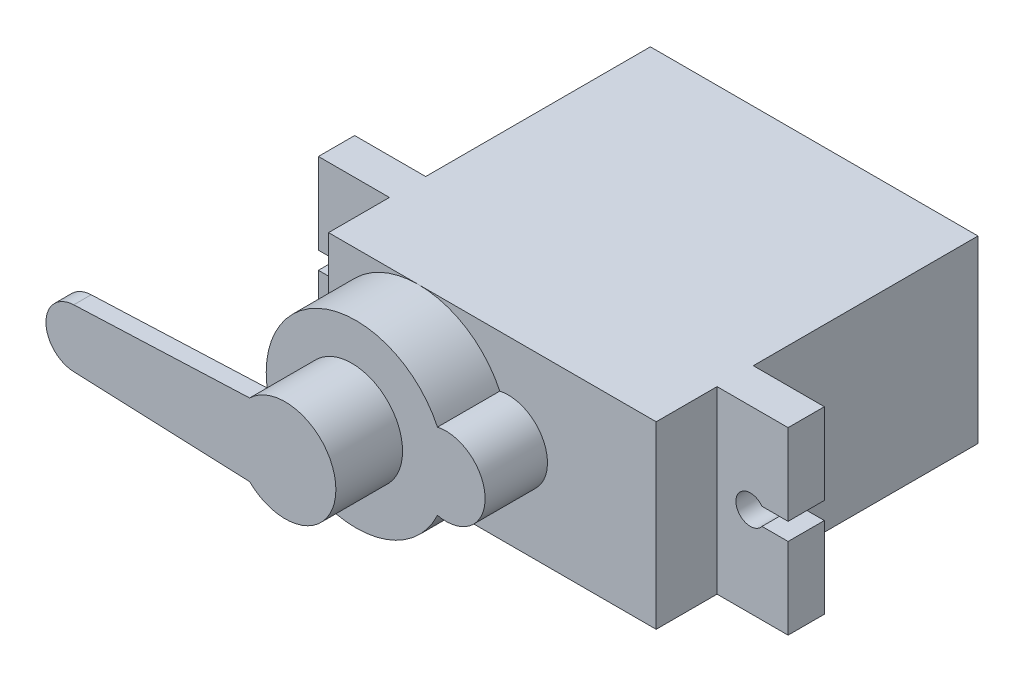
from build123d import *

# Parameters (mm, degrees)
SKIZZE1_W                       = 22.6
SKIZZE1_H                       = 12.4
AUFSATZ_LINEAR_AUSTRAGEN1_DEPTH = 22.2
SKIZZE2_R                       = 6.2
AUFSATZ_LINEAR_AUSTRAGEN2_DEPTH = 4.3
SKIZZE3_R                       = 2.7
AUFSATZ_LINEAR_AUSTRAGEN3_DEPTH = 4.3
SKIZZE4_R                       = 3.5
AUFSATZ_LINEAR_AUSTRAGEN4_DEPTH = 4.6
AUFSATZ_LINEAR_AUSTRAGEN5_DEPTH = 1.2
AUFSATZ_LINEAR_START            = 15.5
AUFSATZ_LINEAR_AUSTRAGEN6_DEPTH = 2.5
SKIZZE7_R                       = 1
SCHNITT_LINEAR_AUSTRAGEN1_DEPTH = 2.5
SKIZZE8_W                       = 1.5
SKIZZE8_H                       = 3.5
AUFSATZ_LINEAR_AUSTRAGEN7_DEPTH = 2.5


with BuildPart() as part:
    # Skizze1 → Aufsatz-Linear austragen1 (new body)
    with BuildSketch(Plane.XY):
        Rectangle(SKIZZE1_W, SKIZZE1_H)
    extrude(amount=AUFSATZ_LINEAR_AUSTRAGEN1_DEPTH)

    # Skizze2 → Aufsatz-Linear austragen2 (add)
    with BuildSketch(Plane.XY.offset(22.2)):
        with Locations(Location((-5.1, 0, 0), (0, 0, 180))):
            Circle(SKIZZE2_R)
    extrude(amount=AUFSATZ_LINEAR_AUSTRAGEN2_DEPTH)

    # Skizze3 → Aufsatz-Linear austragen3 (add)
    with BuildSketch(Plane.XY.offset(22.2)):
        with Locations((1.1, 0)):
            Circle(SKIZZE3_R)
    extrude(amount=AUFSATZ_LINEAR_AUSTRAGEN3_DEPTH)

    # Skizze4 → Aufsatz-Linear austragen4 (add)
    with BuildSketch(Plane.XY.offset(26.5)):
        with Locations((-5.394678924, 0)):
            Circle(SKIZZE4_R)
    extrude(amount=AUFSATZ_LINEAR_AUSTRAGEN4_DEPTH)

    # Skizze5 → Aufsatz-Linear austragen5 (add)
    with BuildSketch(Plane.XY.offset(31.1)):
        with BuildLine():
            Line((-7.844168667, 2.5), (-19.975412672, 2))
            ThreePointArc((-19.975412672, 2), (-21.894678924, 0), (-19.975412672, -2))
            Line((-19.975412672, -2), (-7.844168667, -2.5))
            Line((-7.844168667, -2.5), (-7.844168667, 2.5))
        make_face()
    extrude(amount=-AUFSATZ_LINEAR_AUSTRAGEN5_DEPTH)

    # Skizze6 → Aufsatz-Linear austragen6 (add)
    with BuildSketch(Plane.XY.offset(AUFSATZ_LINEAR_START)):
        Polygon((-11.3, 6.2), (-16.2, 6.2), (-16.2, 0.6), (-13.2, 0.6), (-13.2, -0.6), (-16.2, -0.6), (-16.2, -6.2), (-11.3, -6.2), align=None)
    aufsatz_linear_austragen6 = extrude(amount=AUFSATZ_LINEAR_AUSTRAGEN6_DEPTH)

    # Skizze7 → Schnitt-Linear austragen1 (cut)
    with BuildSketch(Plane.XY.offset(18)):
        with Locations((-13.6, 0)):
            Circle(SKIZZE7_R)
    schnitt_linear_austragen1 = extrude(amount=-SCHNITT_LINEAR_AUSTRAGEN1_DEPTH, mode=Mode.SUBTRACT)

    # Spiegeln1: Aufsatz-Linear austragen6, Schnitt-Linear austragen1 across plane
    add(aufsatz_linear_austragen6.mirror(Plane(origin=(0, 0, 0), x_dir=(0, 0, 1), z_dir=(1, 0, 0))))
    add(schnitt_linear_austragen1.mirror(Plane(origin=(0, 0, 0), x_dir=(0, 0, 1), z_dir=(1, 0, 0))), mode=Mode.SUBTRACT)

    # Skizze8 → Aufsatz-Linear austragen7 (add)
    with BuildSketch(Plane.ZY.offset(11.3)):
        with Locations((4.75, 0)):
            Rectangle(SKIZZE8_W, SKIZZE8_H)
    extrude(amount=AUFSATZ_LINEAR_AUSTRAGEN7_DEPTH)


solid = part.part
